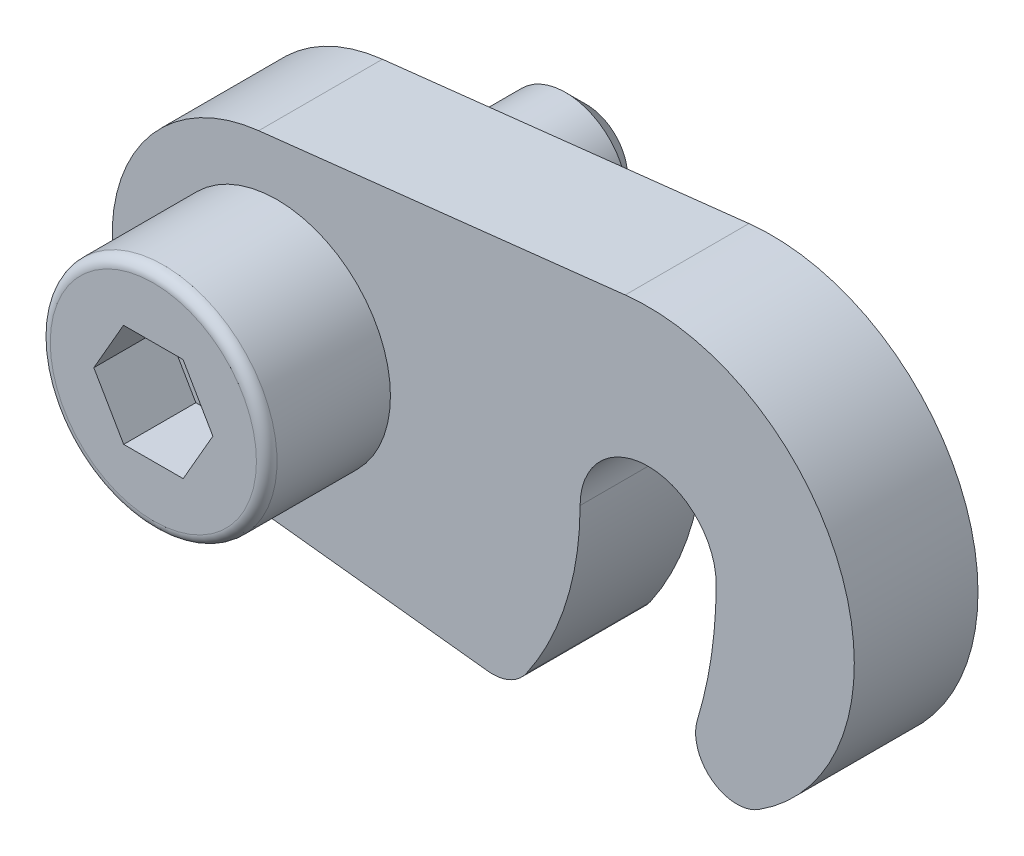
ISO-10303-21;
HEADER;
FILE_DESCRIPTION(('STEP AP214'),'2;1');
FILE_NAME('part.step','',(''),(''),'','','');
FILE_SCHEMA(('AUTOMOTIVE_DESIGN { 1 0 10303 214 1 1 1 1 }'));
ENDSEC;
DATA;
#1=APPLICATION_CONTEXT('core data for automotive mechanical design processes');
#2=APPLICATION_PROTOCOL_DEFINITION('international standard','automotive_design',2000,#1);
#3=PRODUCT_CONTEXT('',#1,'mechanical');
#4=PRODUCT('Part','Part','',(#3));
#5=PRODUCT_RELATED_PRODUCT_CATEGORY('part','',(#4));
#6=PRODUCT_DEFINITION_FORMATION('','',#4);
#7=PRODUCT_DEFINITION_CONTEXT('part definition',#1,'design');
#8=PRODUCT_DEFINITION('design','',#6,#7);
#9=PRODUCT_DEFINITION_SHAPE('','',#8);
#10=(LENGTH_UNIT() NAMED_UNIT(*) SI_UNIT(.MILLI.,.METRE.));
#11=(NAMED_UNIT(*) PLANE_ANGLE_UNIT() SI_UNIT($,.RADIAN.));
#12=(NAMED_UNIT(*) SI_UNIT($,.STERADIAN.) SOLID_ANGLE_UNIT());
#13=UNCERTAINTY_MEASURE_WITH_UNIT(LENGTH_MEASURE(1.E-05),#10,'distance_accuracy_value','');
#14=(GEOMETRIC_REPRESENTATION_CONTEXT(3) GLOBAL_UNCERTAINTY_ASSIGNED_CONTEXT((#13)) GLOBAL_UNIT_ASSIGNED_CONTEXT((#10,
#11,#12)) REPRESENTATION_CONTEXT('',''));
#15=CARTESIAN_POINT('',(0.,0.,0.));
#16=DIRECTION('',(0.,0.,1.));
#17=DIRECTION('',(1.,0.,0.));
#18=AXIS2_PLACEMENT_3D('',#15,#16,#17);
#19=CARTESIAN_POINT('',(18.,1.38777878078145E-13,7.));
#20=DIRECTION('',(0.,0.,-1.));
#21=DIRECTION('',(0.,1.,0.));
#22=AXIS2_PLACEMENT_3D('',#19,#20,#21);
#23=CYLINDRICAL_SURFACE('',#22,10.);
#24=CARTESIAN_POINT('',(18.,1.38777878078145E-13,1.));
#25=DIRECTION('',(0.,0.,1.));
#26=DIRECTION('',(0.,-1.,0.));
#27=AXIS2_PLACEMENT_3D('',#24,#25,#26);
#28=CIRCLE('',#27,10.);
#29=CARTESIAN_POINT('',(23.378125,-8.43064478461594,1.));
#30=VERTEX_POINT('',#29);
#31=CARTESIAN_POINT('',(16.8888888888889,9.93807989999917,1.));
#32=VERTEX_POINT('',#31);
#33=EDGE_CURVE('E169',#30,#32,#28,.T.);
#34=ORIENTED_EDGE('',*,*,#33,.T.);
#35=DIRECTION('',(0.,0.,-1.));
#36=VECTOR('',#35,1.);
#37=CARTESIAN_POINT('',(16.8888888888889,9.93807989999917,7.));
#38=LINE('',#37,#36);
#39=CARTESIAN_POINT('',(16.8888888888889,9.93807989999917,7.));
#40=VERTEX_POINT('',#39);
#41=EDGE_CURVE('E214',#40,#32,#38,.T.);
#42=ORIENTED_EDGE('',*,*,#41,.F.);
#43=CARTESIAN_POINT('',(18.,1.38777878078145E-13,7.));
#44=DIRECTION('',(0.,0.,1.));
#45=DIRECTION('',(0.,-1.,0.));
#46=AXIS2_PLACEMENT_3D('',#43,#44,#45);
#47=CIRCLE('',#46,10.);
#48=CARTESIAN_POINT('',(23.378125,-8.43064478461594,7.));
#49=VERTEX_POINT('',#48);
#50=EDGE_CURVE('E294',#49,#40,#47,.T.);
#51=ORIENTED_EDGE('',*,*,#50,.F.);
#52=DIRECTION('',(0.,0.,-1.));
#53=VECTOR('',#52,1.);
#54=CARTESIAN_POINT('',(23.378125,-8.43064478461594,7.));
#55=LINE('',#54,#53);
#56=EDGE_CURVE('E217',#49,#30,#55,.T.);
#57=ORIENTED_EDGE('',*,*,#56,.T.);
#58=EDGE_LOOP('',(#34,#42,#51,#57));
#59=FACE_BOUND('',#58,.T.);
#60=ADVANCED_FACE('F14',(#59),#23,.T.);
#61=CARTESIAN_POINT('',(-0.888888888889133,7.9504639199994,7.));
#62=DIRECTION('',(0.111111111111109,-0.993807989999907,0.));
#63=DIRECTION('',(0.993807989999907,0.111111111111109,0.));
#64=AXIS2_PLACEMENT_3D('',#61,#62,#63);
#65=PLANE('',#64);
#66=DIRECTION('',(-0.993807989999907,-0.111111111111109,0.));
#67=VECTOR('',#66,1.);
#68=CARTESIAN_POINT('',(-0.888888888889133,7.9504639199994,1.));
#69=LINE('',#68,#67);
#70=CARTESIAN_POINT('',(-0.888888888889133,7.9504639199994,1.));
#71=VERTEX_POINT('',#70);
#72=EDGE_CURVE('E175',#32,#71,#69,.T.);
#73=ORIENTED_EDGE('',*,*,#72,.T.);
#74=DIRECTION('',(0.,0.,-1.));
#75=VECTOR('',#74,1.);
#76=CARTESIAN_POINT('',(-0.888888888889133,7.9504639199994,7.));
#77=LINE('',#76,#75);
#78=CARTESIAN_POINT('',(-0.888888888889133,7.9504639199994,7.));
#79=VERTEX_POINT('',#78);
#80=EDGE_CURVE('E211',#79,#71,#77,.T.);
#81=ORIENTED_EDGE('',*,*,#80,.F.);
#82=DIRECTION('',(-0.993807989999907,-0.111111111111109,0.));
#83=VECTOR('',#82,1.);
#84=CARTESIAN_POINT('',(-0.888888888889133,7.9504639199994,7.));
#85=LINE('',#84,#83);
#86=EDGE_CURVE('E301',#40,#79,#85,.T.);
#87=ORIENTED_EDGE('',*,*,#86,.F.);
#88=ORIENTED_EDGE('',*,*,#41,.T.);
#89=EDGE_LOOP('',(#73,#81,#87,#88));
#90=FACE_BOUND('',#89,.T.);
#91=ADVANCED_FACE('F333',(#90),#65,.F.);
#92=CARTESIAN_POINT('',(0.,0.,7.));
#93=DIRECTION('',(0.,0.,-1.));
#94=DIRECTION('',(0.,1.,0.));
#95=AXIS2_PLACEMENT_3D('',#92,#93,#94);
#96=CYLINDRICAL_SURFACE('',#95,8.);
#97=CARTESIAN_POINT('',(0.,0.,1.));
#98=DIRECTION('',(0.,0.,1.));
#99=DIRECTION('',(0.,-1.,0.));
#100=AXIS2_PLACEMENT_3D('',#97,#98,#99);
#101=CIRCLE('',#100,8.);
#102=CARTESIAN_POINT('',(-0.888888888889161,-7.95046391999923,1.));
#103=VERTEX_POINT('',#102);
#104=EDGE_CURVE('E181',#71,#103,#101,.T.);
#105=ORIENTED_EDGE('',*,*,#104,.T.);
#106=DIRECTION('',(0.,0.,-1.));
#107=VECTOR('',#106,1.);
#108=CARTESIAN_POINT('',(-0.888888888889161,-7.95046391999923,7.));
#109=LINE('',#108,#107);
#110=CARTESIAN_POINT('',(-0.888888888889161,-7.95046391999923,7.));
#111=VERTEX_POINT('',#110);
#112=EDGE_CURVE('E208',#111,#103,#109,.T.);
#113=ORIENTED_EDGE('',*,*,#112,.F.);
#114=CARTESIAN_POINT('',(0.,0.,7.));
#115=DIRECTION('',(0.,0.,1.));
#116=DIRECTION('',(0.,-1.,0.));
#117=AXIS2_PLACEMENT_3D('',#114,#115,#116);
#118=CIRCLE('',#117,8.);
#119=EDGE_CURVE('E303',#79,#111,#118,.T.);
#120=ORIENTED_EDGE('',*,*,#119,.F.);
#121=ORIENTED_EDGE('',*,*,#80,.T.);
#122=EDGE_LOOP('',(#105,#113,#120,#121));
#123=FACE_BOUND('',#122,.T.);
#124=ADVANCED_FACE('F337',(#123),#96,.T.);
#125=CARTESIAN_POINT('',(-0.888888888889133,-7.9504639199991,7.));
#126=DIRECTION('',(0.111111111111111,0.993807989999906,0.));
#127=DIRECTION('',(-0.993807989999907,0.111111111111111,0.));
#128=AXIS2_PLACEMENT_3D('',#125,#126,#127);
#129=PLANE('',#128);
#130=DIRECTION('',(0.993807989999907,-0.111111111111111,0.));
#131=VECTOR('',#130,1.);
#132=CARTESIAN_POINT('',(-0.888888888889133,-7.9504639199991,1.));
#133=LINE('',#132,#131);
#134=CARTESIAN_POINT('',(10.2351036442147,-9.1941640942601,1.));
#135=VERTEX_POINT('',#134);
#136=EDGE_CURVE('E183',#103,#135,#133,.T.);
#137=ORIENTED_EDGE('',*,*,#136,.T.);
#138=DIRECTION('',(0.,0.,-1.));
#139=VECTOR('',#138,1.);
#140=CARTESIAN_POINT('',(10.2351036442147,-9.1941640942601,7.));
#141=LINE('',#140,#139);
#142=CARTESIAN_POINT('',(10.2351036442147,-9.1941640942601,7.));
#143=VERTEX_POINT('',#142);
#144=EDGE_CURVE('E205',#143,#135,#141,.T.);
#145=ORIENTED_EDGE('',*,*,#144,.F.);
#146=DIRECTION('',(0.993807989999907,-0.111111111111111,0.));
#147=VECTOR('',#146,1.);
#148=CARTESIAN_POINT('',(-0.888888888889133,-7.9504639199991,7.));
#149=LINE('',#148,#147);
#150=EDGE_CURVE('E308',#111,#143,#149,.T.);
#151=ORIENTED_EDGE('',*,*,#150,.F.);
#152=ORIENTED_EDGE('',*,*,#112,.T.);
#153=EDGE_LOOP('',(#137,#145,#151,#152));
#154=FACE_BOUND('',#153,.T.);
#155=ADVANCED_FACE('F358',(#154),#129,.F.);
#156=CARTESIAN_POINT('',(10.4573258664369,-7.20654811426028,7.));
#157=DIRECTION('',(0.,0.,-1.));
#158=DIRECTION('',(0.,1.,0.));
#159=AXIS2_PLACEMENT_3D('',#156,#157,#158);
#160=CYLINDRICAL_SURFACE('',#159,2.);
#161=CARTESIAN_POINT('',(10.4573258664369,-7.20654811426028,1.));
#162=DIRECTION('',(0.,0.,1.));
#163=DIRECTION('',(0.,-1.,0.));
#164=AXIS2_PLACEMENT_3D('',#161,#162,#163);
#165=CIRCLE('',#164,2.);
#166=CARTESIAN_POINT('',(12.1041488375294,-8.34143758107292,1.));
#167=VERTEX_POINT('',#166);
#168=EDGE_CURVE('E185',#135,#167,#165,.T.);
#169=ORIENTED_EDGE('',*,*,#168,.T.);
#170=DIRECTION('',(0.,0.,-1.));
#171=VECTOR('',#170,1.);
#172=CARTESIAN_POINT('',(12.1041488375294,-8.34143758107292,7.));
#173=LINE('',#172,#171);
#174=CARTESIAN_POINT('',(12.1041488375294,-8.34143758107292,7.));
#175=VERTEX_POINT('',#174);
#176=EDGE_CURVE('E202',#175,#167,#173,.T.);
#177=ORIENTED_EDGE('',*,*,#176,.F.);
#178=CARTESIAN_POINT('',(10.4573258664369,-7.20654811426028,7.));
#179=DIRECTION('',(0.,0.,1.));
#180=DIRECTION('',(0.,-1.,0.));
#181=AXIS2_PLACEMENT_3D('',#178,#179,#180);
#182=CIRCLE('',#181,2.);
#183=EDGE_CURVE('E311',#143,#175,#182,.T.);
#184=ORIENTED_EDGE('',*,*,#183,.F.);
#185=ORIENTED_EDGE('',*,*,#144,.T.);
#186=EDGE_LOOP('',(#169,#177,#184,#185));
#187=FACE_BOUND('',#186,.T.);
#188=ADVANCED_FACE('F352',(#187),#160,.T.);
#189=CARTESIAN_POINT('',(0.,0.,7.));
#190=DIRECTION('',(0.,0.,-1.));
#191=DIRECTION('',(0.,1.,0.));
#192=AXIS2_PLACEMENT_3D('',#189,#190,#191);
#193=CYLINDRICAL_SURFACE('',#192,14.7);
#194=CARTESIAN_POINT('',(0.,0.,1.));
#195=DIRECTION('',(0.,0.,1.));
#196=DIRECTION('',(0.,-1.,0.));
#197=AXIS2_PLACEMENT_3D('',#194,#195,#196);
#198=CIRCLE('',#197,14.7);
#199=CARTESIAN_POINT('',(14.7,1.11022302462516E-13,1.));
#200=VERTEX_POINT('',#199);
#201=EDGE_CURVE('E187',#167,#200,#198,.T.);
#202=ORIENTED_EDGE('',*,*,#201,.T.);
#203=DIRECTION('',(0.,0.,-1.));
#204=VECTOR('',#203,1.);
#205=CARTESIAN_POINT('',(14.7,1.11022302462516E-13,7.));
#206=LINE('',#205,#204);
#207=CARTESIAN_POINT('',(14.7,1.11022302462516E-13,7.));
#208=VERTEX_POINT('',#207);
#209=EDGE_CURVE('E199',#208,#200,#206,.T.);
#210=ORIENTED_EDGE('',*,*,#209,.F.);
#211=CARTESIAN_POINT('',(0.,0.,7.));
#212=DIRECTION('',(0.,0.,1.));
#213=DIRECTION('',(0.,-1.,0.));
#214=AXIS2_PLACEMENT_3D('',#211,#212,#213);
#215=CIRCLE('',#214,14.7);
#216=EDGE_CURVE('E314',#175,#208,#215,.T.);
#217=ORIENTED_EDGE('',*,*,#216,.F.);
#218=ORIENTED_EDGE('',*,*,#176,.T.);
#219=EDGE_LOOP('',(#202,#210,#217,#218));
#220=FACE_BOUND('',#219,.T.);
#221=ADVANCED_FACE('F356',(#220),#193,.T.);
#222=CARTESIAN_POINT('',(18.,1.38777878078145E-13,7.));
#223=DIRECTION('',(0.,0.,-1.));
#224=DIRECTION('',(0.,1.,0.));
#225=AXIS2_PLACEMENT_3D('',#222,#223,#224);
#226=CYLINDRICAL_SURFACE('',#225,3.3);
#227=CARTESIAN_POINT('',(18.,1.38777878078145E-13,1.));
#228=DIRECTION('',(0.,0.,-1.));
#229=DIRECTION('',(0.,-1.,0.));
#230=AXIS2_PLACEMENT_3D('',#227,#228,#229);
#231=CIRCLE('',#230,3.3);
#232=CARTESIAN_POINT('',(21.3,1.66533453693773E-13,1.));
#233=VERTEX_POINT('',#232);
#234=EDGE_CURVE('E189',#200,#233,#231,.T.);
#235=ORIENTED_EDGE('',*,*,#234,.T.);
#236=DIRECTION('',(0.,0.,-1.));
#237=VECTOR('',#236,1.);
#238=CARTESIAN_POINT('',(21.3,1.66533453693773E-13,7.));
#239=LINE('',#238,#237);
#240=CARTESIAN_POINT('',(21.3,1.66533453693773E-13,7.));
#241=VERTEX_POINT('',#240);
#242=EDGE_CURVE('E196',#241,#233,#239,.T.);
#243=ORIENTED_EDGE('',*,*,#242,.F.);
#244=CARTESIAN_POINT('',(18.,1.38777878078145E-13,7.));
#245=DIRECTION('',(0.,0.,-1.));
#246=DIRECTION('',(0.,-1.,0.));
#247=AXIS2_PLACEMENT_3D('',#244,#245,#246);
#248=CIRCLE('',#247,3.3);
#249=EDGE_CURVE('E316',#208,#241,#248,.T.);
#250=ORIENTED_EDGE('',*,*,#249,.F.);
#251=ORIENTED_EDGE('',*,*,#209,.T.);
#252=EDGE_LOOP('',(#235,#243,#250,#251));
#253=FACE_BOUND('',#252,.T.);
#254=ADVANCED_FACE('F322',(#253),#226,.F.);
#255=CARTESIAN_POINT('',(0.,0.,7.));
#256=DIRECTION('',(0.,0.,-1.));
#257=DIRECTION('',(0.,1.,0.));
#258=AXIS2_PLACEMENT_3D('',#255,#256,#257);
#259=CYLINDRICAL_SURFACE('',#258,21.3);
#260=CARTESIAN_POINT('',(0.,0.,1.));
#261=DIRECTION('',(0.,0.,-1.));
#262=DIRECTION('',(0.,-1.,0.));
#263=AXIS2_PLACEMENT_3D('',#260,#261,#262);
#264=CIRCLE('',#263,21.3);
#265=CARTESIAN_POINT('',(20.3881223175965,-6.16558743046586,1.));
#266=VERTEX_POINT('',#265);
#267=EDGE_CURVE('E191',#233,#266,#264,.T.);
#268=ORIENTED_EDGE('',*,*,#267,.T.);
#269=DIRECTION('',(0.,0.,-1.));
#270=VECTOR('',#269,1.);
#271=CARTESIAN_POINT('',(20.3881223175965,-6.16558743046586,7.));
#272=LINE('',#271,#270);
#273=CARTESIAN_POINT('',(20.3881223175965,-6.16558743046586,7.));
#274=VERTEX_POINT('',#273);
#275=EDGE_CURVE('E194',#274,#266,#272,.T.);
#276=ORIENTED_EDGE('',*,*,#275,.F.);
#277=CARTESIAN_POINT('',(0.,0.,7.));
#278=DIRECTION('',(0.,0.,-1.));
#279=DIRECTION('',(0.,-1.,0.));
#280=AXIS2_PLACEMENT_3D('',#277,#278,#279);
#281=CIRCLE('',#280,21.3);
#282=EDGE_CURVE('E33',#241,#274,#281,.T.);
#283=ORIENTED_EDGE('',*,*,#282,.F.);
#284=ORIENTED_EDGE('',*,*,#242,.T.);
#285=EDGE_LOOP('',(#268,#276,#283,#284));
#286=FACE_BOUND('',#285,.T.);
#287=ADVANCED_FACE('F326',(#286),#259,.F.);
#288=CARTESIAN_POINT('',(22.3025,-6.74451582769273,7.));
#289=DIRECTION('',(0.,0.,-1.));
#290=DIRECTION('',(0.,1.,0.));
#291=AXIS2_PLACEMENT_3D('',#288,#289,#290);
#292=CYLINDRICAL_SURFACE('',#291,2.);
#293=CARTESIAN_POINT('',(22.3025,-6.74451582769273,1.));
#294=DIRECTION('',(0.,0.,1.));
#295=DIRECTION('',(0.,-1.,0.));
#296=AXIS2_PLACEMENT_3D('',#293,#294,#295);
#297=CIRCLE('',#296,2.);
#298=EDGE_CURVE('E165',#266,#30,#297,.T.);
#299=ORIENTED_EDGE('',*,*,#298,.T.);
#300=ORIENTED_EDGE('',*,*,#56,.F.);
#301=CARTESIAN_POINT('',(22.3025,-6.74451582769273,7.));
#302=DIRECTION('',(0.,0.,1.));
#303=DIRECTION('',(0.,-1.,0.));
#304=AXIS2_PLACEMENT_3D('',#301,#302,#303);
#305=CIRCLE('',#304,2.);
#306=EDGE_CURVE('E193',#274,#49,#305,.T.);
#307=ORIENTED_EDGE('',*,*,#306,.F.);
#308=ORIENTED_EDGE('',*,*,#275,.T.);
#309=EDGE_LOOP('',(#299,#300,#307,#308));
#310=FACE_BOUND('',#309,.T.);
#311=ADVANCED_FACE('F298',(#310),#292,.T.);
#312=CARTESIAN_POINT('',(22.3025,-6.74451582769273,1.));
#313=DIRECTION('',(0.,0.,1.));
#314=DIRECTION('',(0.,-1.,0.));
#315=AXIS2_PLACEMENT_3D('',#312,#313,#314);
#316=PLANE('',#315);
#317=CARTESIAN_POINT('',(0.,0.,1.));
#318=DIRECTION('',(0.,0.,1.));
#319=DIRECTION('',(1.,0.,0.));
#320=AXIS2_PLACEMENT_3D('',#317,#318,#319);
#321=CIRCLE('',#320,4.);
#322=CARTESIAN_POINT('',(4.,0.,1.));
#323=VERTEX_POINT('',#322);
#324=EDGE_CURVE('E24',#323,#323,#321,.F.);
#325=ORIENTED_EDGE('',*,*,#324,.F.);
#326=EDGE_LOOP('',(#325));
#327=FACE_BOUND('',#326,.T.);
#328=ORIENTED_EDGE('',*,*,#298,.F.);
#329=ORIENTED_EDGE('',*,*,#267,.F.);
#330=ORIENTED_EDGE('',*,*,#234,.F.);
#331=ORIENTED_EDGE('',*,*,#201,.F.);
#332=ORIENTED_EDGE('',*,*,#168,.F.);
#333=ORIENTED_EDGE('',*,*,#136,.F.);
#334=ORIENTED_EDGE('',*,*,#104,.F.);
#335=ORIENTED_EDGE('',*,*,#72,.F.);
#336=ORIENTED_EDGE('',*,*,#33,.F.);
#337=EDGE_LOOP('',(#328,#329,#330,#331,#332,#333,#334,#335,#336));
#338=FACE_BOUND('',#337,.T.);
#339=ADVANCED_FACE('F267',(#327,#338),#316,.F.);
#340=CARTESIAN_POINT('',(22.3025,-6.74451582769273,7.));
#341=DIRECTION('',(0.,0.,1.));
#342=DIRECTION('',(0.,-1.,0.));
#343=AXIS2_PLACEMENT_3D('',#340,#341,#342);
#344=PLANE('',#343);
#345=CARTESIAN_POINT('',(0.,0.,7.));
#346=DIRECTION('',(0.,0.,1.));
#347=DIRECTION('',(1.,0.,0.));
#348=AXIS2_PLACEMENT_3D('',#345,#346,#347);
#349=CIRCLE('',#348,5.5);
#350=CARTESIAN_POINT('',(5.5,0.,7.));
#351=VERTEX_POINT('',#350);
#352=EDGE_CURVE('E9',#351,#351,#349,.F.);
#353=ORIENTED_EDGE('',*,*,#352,.T.);
#354=EDGE_LOOP('',(#353));
#355=FACE_BOUND('',#354,.T.);
#356=ORIENTED_EDGE('',*,*,#306,.T.);
#357=ORIENTED_EDGE('',*,*,#50,.T.);
#358=ORIENTED_EDGE('',*,*,#86,.T.);
#359=ORIENTED_EDGE('',*,*,#119,.T.);
#360=ORIENTED_EDGE('',*,*,#150,.T.);
#361=ORIENTED_EDGE('',*,*,#183,.T.);
#362=ORIENTED_EDGE('',*,*,#216,.T.);
#363=ORIENTED_EDGE('',*,*,#249,.T.);
#364=ORIENTED_EDGE('',*,*,#282,.T.);
#365=EDGE_LOOP('',(#356,#357,#358,#359,#360,#361,#362,#363,#364));
#366=FACE_BOUND('',#365,.T.);
#367=ADVANCED_FACE('F259',(#355,#366),#344,.T.);
#368=CARTESIAN_POINT('',(3.,0.,-8.));
#369=DIRECTION('',(0.,0.,1.));
#370=DIRECTION('',(0.,-1.,0.));
#371=AXIS2_PLACEMENT_3D('',#368,#369,#370);
#372=PLANE('',#371);
#373=CARTESIAN_POINT('',(0.,0.,-8.));
#374=DIRECTION('',(0.,0.,1.));
#375=DIRECTION('',(1.,0.,0.));
#376=AXIS2_PLACEMENT_3D('',#373,#374,#375);
#377=CIRCLE('',#376,2.);
#378=CARTESIAN_POINT('',(2.,0.,-8.));
#379=VERTEX_POINT('',#378);
#380=EDGE_CURVE('E18',#379,#379,#377,.F.);
#381=ORIENTED_EDGE('',*,*,#380,.T.);
#382=EDGE_LOOP('',(#381));
#383=FACE_BOUND('',#382,.T.);
#384=ADVANCED_FACE('F257',(#383),#372,.F.);
#385=CARTESIAN_POINT('',(0.,0.,-7.));
#386=DIRECTION('',(0.,0.,1.));
#387=DIRECTION('',(1.,0.,0.));
#388=AXIS2_PLACEMENT_3D('',#385,#386,#387);
#389=CONICAL_SURFACE('',#388,3.,0.785398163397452);
#390=ORIENTED_EDGE('',*,*,#380,.F.);
#391=EDGE_LOOP('',(#390));
#392=FACE_BOUND('',#391,.T.);
#393=CARTESIAN_POINT('',(0.,0.,-7.));
#394=DIRECTION('',(0.,0.,1.));
#395=DIRECTION('',(1.,0.,0.));
#396=AXIS2_PLACEMENT_3D('',#393,#394,#395);
#397=CIRCLE('',#396,3.);
#398=CARTESIAN_POINT('',(3.,0.,-7.));
#399=VERTEX_POINT('',#398);
#400=EDGE_CURVE('E160',#399,#399,#397,.T.);
#401=ORIENTED_EDGE('',*,*,#400,.F.);
#402=EDGE_LOOP('',(#401));
#403=FACE_BOUND('',#402,.T.);
#404=ADVANCED_FACE('F16',(#392,#403),#389,.T.);
#405=CARTESIAN_POINT('',(0.,0.,22.));
#406=DIRECTION('',(0.,0.,1.));
#407=DIRECTION('',(0.,-1.,0.));
#408=AXIS2_PLACEMENT_3D('',#405,#406,#407);
#409=CYLINDRICAL_SURFACE('',#408,3.);
#410=ORIENTED_EDGE('',*,*,#400,.T.);
#411=EDGE_LOOP('',(#410));
#412=FACE_BOUND('',#411,.T.);
#413=CARTESIAN_POINT('',(0.,0.,0.));
#414=DIRECTION('',(0.,0.,1.));
#415=DIRECTION('',(0.,-1.,0.));
#416=AXIS2_PLACEMENT_3D('',#413,#414,#415);
#417=CIRCLE('',#416,3.);
#418=CARTESIAN_POINT('',(0.,-3.,0.));
#419=VERTEX_POINT('',#418);
#420=EDGE_CURVE('E152',#419,#419,#417,.T.);
#421=ORIENTED_EDGE('',*,*,#420,.F.);
#422=EDGE_LOOP('',(#421));
#423=FACE_BOUND('',#422,.T.);
#424=ADVANCED_FACE('F265',(#412,#423),#409,.T.);
#425=CARTESIAN_POINT('',(4.,0.,0.));
#426=DIRECTION('',(0.,0.,1.));
#427=DIRECTION('',(0.,-1.,0.));
#428=AXIS2_PLACEMENT_3D('',#425,#426,#427);
#429=PLANE('',#428);
#430=CARTESIAN_POINT('',(0.,0.,0.));
#431=DIRECTION('',(0.,0.,1.));
#432=DIRECTION('',(0.,-1.,0.));
#433=AXIS2_PLACEMENT_3D('',#430,#431,#432);
#434=CIRCLE('',#433,4.);
#435=CARTESIAN_POINT('',(0.,-4.,0.));
#436=VERTEX_POINT('',#435);
#437=EDGE_CURVE('E112',#436,#436,#434,.T.);
#438=ORIENTED_EDGE('',*,*,#437,.F.);
#439=EDGE_LOOP('',(#438));
#440=FACE_BOUND('',#439,.T.);
#441=ORIENTED_EDGE('',*,*,#420,.T.);
#442=EDGE_LOOP('',(#441));
#443=FACE_BOUND('',#442,.T.);
#444=ADVANCED_FACE('F382',(#440,#443),#429,.F.);
#445=CARTESIAN_POINT('',(0.,0.,22.));
#446=DIRECTION('',(0.,0.,1.));
#447=DIRECTION('',(0.,-1.,0.));
#448=AXIS2_PLACEMENT_3D('',#445,#446,#447);
#449=CYLINDRICAL_SURFACE('',#448,4.);
#450=ORIENTED_EDGE('',*,*,#437,.T.);
#451=EDGE_LOOP('',(#450));
#452=FACE_BOUND('',#451,.T.);
#453=ORIENTED_EDGE('',*,*,#324,.T.);
#454=EDGE_LOOP('',(#453));
#455=FACE_BOUND('',#454,.T.);
#456=ADVANCED_FACE('F373',(#452,#455),#449,.T.);
#457=CARTESIAN_POINT('',(1.43873533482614,2.50267336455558,9.5));
#458=DIRECTION('',(0.,0.,1.));
#459=DIRECTION('',(1.,0.,0.));
#460=AXIS2_PLACEMENT_3D('',#457,#458,#459);
#461=PLANE('',#460);
#462=DIRECTION('',(-0.501605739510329,0.865096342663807,0.));
#463=VECTOR('',#462,1.);
#464=CARTESIAN_POINT('',(2.88674637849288,0.00535533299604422,9.5));
#465=LINE('',#464,#463);
#466=CARTESIAN_POINT('',(2.88674637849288,0.00535533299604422,9.5));
#467=VERTEX_POINT('',#466);
#468=CARTESIAN_POINT('',(1.43873533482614,2.50267336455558,9.5));
#469=VERTEX_POINT('',#468);
#470=EDGE_CURVE('E108',#467,#469,#465,.T.);
#471=ORIENTED_EDGE('',*,*,#470,.T.);
#472=DIRECTION('',(-0.99999827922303,-0.0018551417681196,0.));
#473=VECTOR('',#472,1.);
#474=CARTESIAN_POINT('',(1.43873533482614,2.50267336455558,9.5));
#475=LINE('',#474,#473);
#476=CARTESIAN_POINT('',(-1.44801104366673,2.49731803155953,9.5));
#477=VERTEX_POINT('',#476);
#478=EDGE_CURVE('E223',#469,#477,#475,.T.);
#479=ORIENTED_EDGE('',*,*,#478,.T.);
#480=DIRECTION('',(-0.498392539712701,-0.866951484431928,0.));
#481=VECTOR('',#480,1.);
#482=CARTESIAN_POINT('',(-1.44801104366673,2.49731803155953,9.5));
#483=LINE('',#482,#481);
#484=CARTESIAN_POINT('',(-2.88674637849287,-0.00535533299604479,9.5));
#485=VERTEX_POINT('',#484);
#486=EDGE_CURVE('E226',#477,#485,#483,.T.);
#487=ORIENTED_EDGE('',*,*,#486,.T.);
#488=DIRECTION('',(0.501605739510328,-0.865096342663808,0.));
#489=VECTOR('',#488,1.);
#490=CARTESIAN_POINT('',(-2.88674637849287,-0.00535533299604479,9.5));
#491=LINE('',#490,#489);
#492=CARTESIAN_POINT('',(-1.43873533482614,-2.50267336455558,9.5));
#493=VERTEX_POINT('',#492);
#494=EDGE_CURVE('E229',#485,#493,#491,.T.);
#495=ORIENTED_EDGE('',*,*,#494,.T.);
#496=DIRECTION('',(0.99999827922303,0.00185514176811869,0.));
#497=VECTOR('',#496,1.);
#498=CARTESIAN_POINT('',(-1.43873533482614,-2.50267336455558,9.5));
#499=LINE('',#498,#497);
#500=CARTESIAN_POINT('',(1.44801104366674,-2.49731803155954,9.5));
#501=VERTEX_POINT('',#500);
#502=EDGE_CURVE('E231',#493,#501,#499,.T.);
#503=ORIENTED_EDGE('',*,*,#502,.T.);
#504=DIRECTION('',(0.498392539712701,0.866951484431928,0.));
#505=VECTOR('',#504,1.);
#506=CARTESIAN_POINT('',(1.44801104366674,-2.49731803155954,9.5));
#507=LINE('',#506,#505);
#508=EDGE_CURVE('E132',#501,#467,#507,.T.);
#509=ORIENTED_EDGE('',*,*,#508,.T.);
#510=EDGE_LOOP('',(#471,#479,#487,#495,#503,#509));
#511=FACE_BOUND('',#510,.T.);
#512=ADVANCED_FACE('F235',(#511),#461,.T.);
#513=CARTESIAN_POINT('',(-1.44801104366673,2.49731803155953,9.5));
#514=DIRECTION('',(-0.866951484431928,0.498392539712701,0.));
#515=DIRECTION('',(-0.498392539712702,-0.866951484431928,0.));
#516=AXIS2_PLACEMENT_3D('',#513,#514,#515);
#517=PLANE('',#516);
#518=DIRECTION('',(-0.498392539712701,-0.866951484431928,0.));
#519=VECTOR('',#518,1.);
#520=CARTESIAN_POINT('',(-1.44801104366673,2.49731803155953,13.));
#521=LINE('',#520,#519);
#522=CARTESIAN_POINT('',(-1.44801104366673,2.49731803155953,13.));
#523=VERTEX_POINT('',#522);
#524=CARTESIAN_POINT('',(-2.88674637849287,-0.00535533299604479,13.));
#525=VERTEX_POINT('',#524);
#526=EDGE_CURVE('E129',#523,#525,#521,.T.);
#527=ORIENTED_EDGE('',*,*,#526,.T.);
#528=DIRECTION('',(0.,0.,1.));
#529=VECTOR('',#528,1.);
#530=CARTESIAN_POINT('',(-2.88674637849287,-0.00535533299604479,9.5));
#531=LINE('',#530,#529);
#532=EDGE_CURVE('E144',#485,#525,#531,.T.);
#533=ORIENTED_EDGE('',*,*,#532,.F.);
#534=ORIENTED_EDGE('',*,*,#486,.F.);
#535=DIRECTION('',(0.,0.,1.));
#536=VECTOR('',#535,1.);
#537=CARTESIAN_POINT('',(-1.44801104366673,2.49731803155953,9.5));
#538=LINE('',#537,#536);
#539=EDGE_CURVE('E146',#477,#523,#538,.T.);
#540=ORIENTED_EDGE('',*,*,#539,.T.);
#541=EDGE_LOOP('',(#527,#533,#534,#540));
#542=FACE_BOUND('',#541,.T.);
#543=ADVANCED_FACE('F241',(#542),#517,.F.);
#544=CARTESIAN_POINT('',(-2.88674637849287,-0.00535533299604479,9.5));
#545=DIRECTION('',(-0.865096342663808,-0.501605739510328,0.));
#546=DIRECTION('',(0.501605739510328,-0.865096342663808,0.));
#547=AXIS2_PLACEMENT_3D('',#544,#545,#546);
#548=PLANE('',#547);
#549=DIRECTION('',(0.501605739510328,-0.865096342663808,0.));
#550=VECTOR('',#549,1.);
#551=CARTESIAN_POINT('',(-2.88674637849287,-0.00535533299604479,13.));
#552=LINE('',#551,#550);
#553=CARTESIAN_POINT('',(-1.43873533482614,-2.50267336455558,13.));
#554=VERTEX_POINT('',#553);
#555=EDGE_CURVE('E137',#525,#554,#552,.T.);
#556=ORIENTED_EDGE('',*,*,#555,.T.);
#557=DIRECTION('',(0.,0.,1.));
#558=VECTOR('',#557,1.);
#559=CARTESIAN_POINT('',(-1.43873533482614,-2.50267336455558,9.5));
#560=LINE('',#559,#558);
#561=EDGE_CURVE('E142',#493,#554,#560,.T.);
#562=ORIENTED_EDGE('',*,*,#561,.F.);
#563=ORIENTED_EDGE('',*,*,#494,.F.);
#564=ORIENTED_EDGE('',*,*,#532,.T.);
#565=EDGE_LOOP('',(#556,#562,#563,#564));
#566=FACE_BOUND('',#565,.T.);
#567=ADVANCED_FACE('F245',(#566),#548,.F.);
#568=CARTESIAN_POINT('',(-1.43873533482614,-2.50267336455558,9.5));
#569=DIRECTION('',(0.00185514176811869,-0.99999827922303,0.));
#570=DIRECTION('',(0.99999827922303,0.00185514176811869,0.));
#571=AXIS2_PLACEMENT_3D('',#568,#569,#570);
#572=PLANE('',#571);
#573=DIRECTION('',(0.99999827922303,0.00185514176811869,0.));
#574=VECTOR('',#573,1.);
#575=CARTESIAN_POINT('',(-1.43873533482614,-2.50267336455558,13.));
#576=LINE('',#575,#574);
#577=CARTESIAN_POINT('',(1.44801104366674,-2.49731803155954,13.));
#578=VERTEX_POINT('',#577);
#579=EDGE_CURVE('E121',#554,#578,#576,.T.);
#580=ORIENTED_EDGE('',*,*,#579,.T.);
#581=DIRECTION('',(0.,0.,1.));
#582=VECTOR('',#581,1.);
#583=CARTESIAN_POINT('',(1.44801104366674,-2.49731803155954,9.5));
#584=LINE('',#583,#582);
#585=EDGE_CURVE('E113',#501,#578,#584,.T.);
#586=ORIENTED_EDGE('',*,*,#585,.F.);
#587=ORIENTED_EDGE('',*,*,#502,.F.);
#588=ORIENTED_EDGE('',*,*,#561,.T.);
#589=EDGE_LOOP('',(#580,#586,#587,#588));
#590=FACE_BOUND('',#589,.T.);
#591=ADVANCED_FACE('F247',(#590),#572,.F.);
#592=CARTESIAN_POINT('',(1.44801104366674,-2.49731803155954,9.5));
#593=DIRECTION('',(0.866951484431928,-0.498392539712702,0.));
#594=DIRECTION('',(0.498392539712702,0.866951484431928,0.));
#595=AXIS2_PLACEMENT_3D('',#592,#593,#594);
#596=PLANE('',#595);
#597=DIRECTION('',(0.498392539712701,0.866951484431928,0.));
#598=VECTOR('',#597,1.);
#599=CARTESIAN_POINT('',(1.44801104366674,-2.49731803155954,13.));
#600=LINE('',#599,#598);
#601=CARTESIAN_POINT('',(2.88674637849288,0.00535533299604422,13.));
#602=VERTEX_POINT('',#601);
#603=EDGE_CURVE('E116',#578,#602,#600,.T.);
#604=ORIENTED_EDGE('',*,*,#603,.T.);
#605=DIRECTION('',(0.,0.,1.));
#606=VECTOR('',#605,1.);
#607=CARTESIAN_POINT('',(2.88674637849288,0.00535533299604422,9.5));
#608=LINE('',#607,#606);
#609=EDGE_CURVE('E101',#467,#602,#608,.T.);
#610=ORIENTED_EDGE('',*,*,#609,.F.);
#611=ORIENTED_EDGE('',*,*,#508,.F.);
#612=ORIENTED_EDGE('',*,*,#585,.T.);
#613=EDGE_LOOP('',(#604,#610,#611,#612));
#614=FACE_BOUND('',#613,.T.);
#615=ADVANCED_FACE('F117',(#614),#596,.F.);
#616=CARTESIAN_POINT('',(2.88674637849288,0.00535533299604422,9.5));
#617=DIRECTION('',(0.865096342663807,0.501605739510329,0.));
#618=DIRECTION('',(-0.501605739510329,0.865096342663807,0.));
#619=AXIS2_PLACEMENT_3D('',#616,#617,#618);
#620=PLANE('',#619);
#621=DIRECTION('',(-0.501605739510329,0.865096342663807,0.));
#622=VECTOR('',#621,1.);
#623=CARTESIAN_POINT('',(2.88674637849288,0.00535533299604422,13.));
#624=LINE('',#623,#622);
#625=CARTESIAN_POINT('',(1.43873533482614,2.50267336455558,13.));
#626=VERTEX_POINT('',#625);
#627=EDGE_CURVE('E105',#602,#626,#624,.T.);
#628=ORIENTED_EDGE('',*,*,#627,.T.);
#629=DIRECTION('',(0.,0.,1.));
#630=VECTOR('',#629,1.);
#631=CARTESIAN_POINT('',(1.43873533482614,2.50267336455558,9.5));
#632=LINE('',#631,#630);
#633=EDGE_CURVE('E148',#469,#626,#632,.T.);
#634=ORIENTED_EDGE('',*,*,#633,.F.);
#635=ORIENTED_EDGE('',*,*,#470,.F.);
#636=ORIENTED_EDGE('',*,*,#609,.T.);
#637=EDGE_LOOP('',(#628,#634,#635,#636));
#638=FACE_BOUND('',#637,.T.);
#639=ADVANCED_FACE('F103',(#638),#620,.F.);
#640=CARTESIAN_POINT('',(1.43873533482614,2.50267336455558,9.5));
#641=DIRECTION('',(-0.0018551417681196,0.99999827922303,0.));
#642=DIRECTION('',(-0.99999827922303,-0.0018551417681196,0.));
#643=AXIS2_PLACEMENT_3D('',#640,#641,#642);
#644=PLANE('',#643);
#645=DIRECTION('',(-0.99999827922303,-0.0018551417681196,0.));
#646=VECTOR('',#645,1.);
#647=CARTESIAN_POINT('',(1.43873533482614,2.50267336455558,13.));
#648=LINE('',#647,#646);
#649=EDGE_CURVE('E127',#626,#523,#648,.T.);
#650=ORIENTED_EDGE('',*,*,#649,.T.);
#651=ORIENTED_EDGE('',*,*,#539,.F.);
#652=ORIENTED_EDGE('',*,*,#478,.F.);
#653=ORIENTED_EDGE('',*,*,#633,.T.);
#654=EDGE_LOOP('',(#650,#651,#652,#653));
#655=FACE_BOUND('',#654,.T.);
#656=ADVANCED_FACE('F239',(#655),#644,.F.);
#657=CARTESIAN_POINT('',(5.5,0.,13.));
#658=DIRECTION('',(0.,0.,-1.));
#659=DIRECTION('',(0.,1.,0.));
#660=AXIS2_PLACEMENT_3D('',#657,#658,#659);
#661=PLANE('',#660);
#662=CARTESIAN_POINT('',(0.,0.,13.));
#663=DIRECTION('',(0.,0.,-1.));
#664=DIRECTION('',(-1.,0.,0.));
#665=AXIS2_PLACEMENT_3D('',#662,#663,#664);
#666=CIRCLE('',#665,5.);
#667=CARTESIAN_POINT('',(-5.,0.,13.));
#668=VERTEX_POINT('',#667);
#669=EDGE_CURVE('E155',#668,#668,#666,.F.);
#670=ORIENTED_EDGE('',*,*,#669,.T.);
#671=EDGE_LOOP('',(#670));
#672=FACE_BOUND('',#671,.T.);
#673=ORIENTED_EDGE('',*,*,#649,.F.);
#674=ORIENTED_EDGE('',*,*,#627,.F.);
#675=ORIENTED_EDGE('',*,*,#603,.F.);
#676=ORIENTED_EDGE('',*,*,#579,.F.);
#677=ORIENTED_EDGE('',*,*,#555,.F.);
#678=ORIENTED_EDGE('',*,*,#526,.F.);
#679=EDGE_LOOP('',(#673,#674,#675,#676,#677,#678));
#680=FACE_BOUND('',#679,.T.);
#681=ADVANCED_FACE('F124',(#672,#680),#661,.F.);
#682=CARTESIAN_POINT('',(0.,0.,12.5));
#683=DIRECTION('',(0.,0.,-1.));
#684=DIRECTION('',(-1.,0.,0.));
#685=AXIS2_PLACEMENT_3D('',#682,#683,#684);
#686=TOROIDAL_SURFACE('',#685,5.,0.5);
#687=CARTESIAN_POINT('',(0.,0.,12.5));
#688=DIRECTION('',(0.,0.,-1.));
#689=DIRECTION('',(-1.,0.,0.));
#690=AXIS2_PLACEMENT_3D('',#687,#688,#689);
#691=CIRCLE('',#690,5.5);
#692=CARTESIAN_POINT('',(-5.5,0.,12.5));
#693=VERTEX_POINT('',#692);
#694=EDGE_CURVE('E158',#693,#693,#691,.T.);
#695=ORIENTED_EDGE('',*,*,#694,.F.);
#696=EDGE_LOOP('',(#695));
#697=FACE_BOUND('',#696,.T.);
#698=ORIENTED_EDGE('',*,*,#669,.F.);
#699=EDGE_LOOP('',(#698));
#700=FACE_BOUND('',#699,.T.);
#701=ADVANCED_FACE('F275',(#697,#700),#686,.T.);
#702=CARTESIAN_POINT('',(0.,0.,22.));
#703=DIRECTION('',(0.,0.,1.));
#704=DIRECTION('',(0.,-1.,0.));
#705=AXIS2_PLACEMENT_3D('',#702,#703,#704);
#706=CYLINDRICAL_SURFACE('',#705,5.5);
#707=ORIENTED_EDGE('',*,*,#694,.T.);
#708=EDGE_LOOP('',(#707));
#709=FACE_BOUND('',#708,.T.);
#710=ORIENTED_EDGE('',*,*,#352,.F.);
#711=EDGE_LOOP('',(#710));
#712=FACE_BOUND('',#711,.T.);
#713=ADVANCED_FACE('F277',(#709,#712),#706,.T.);
#714=CLOSED_SHELL('',(#60,#91,#124,#155,#188,#221,#254,#287,#311,#339,#367,#384,#404,#424,#444,
#456,#512,#543,#567,#591,#615,#639,#656,#681,#701,#713));
#715=MANIFOLD_SOLID_BREP('B1',#714);
#716=ADVANCED_BREP_SHAPE_REPRESENTATION('',(#18,#715),#14);
#717=SHAPE_DEFINITION_REPRESENTATION(#9,#716);
ENDSEC;
END-ISO-10303-21;
